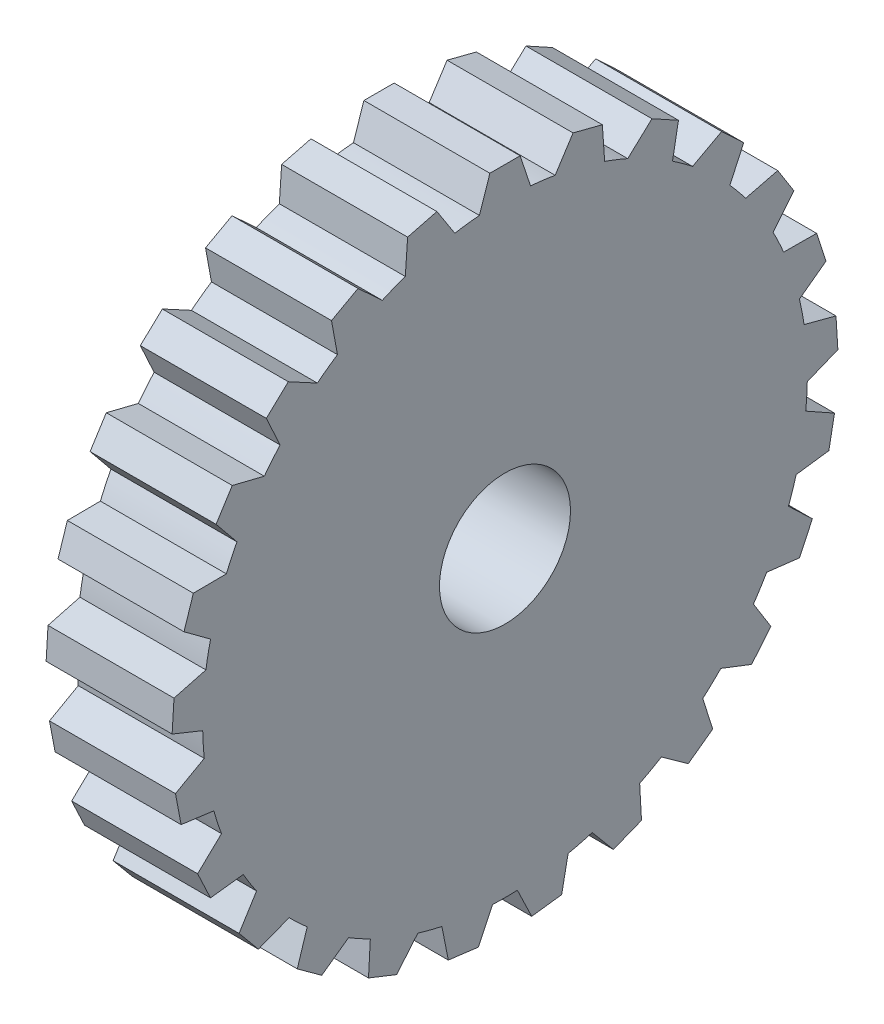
from build123d import *

# Parameters (mm, degrees)
SKETCH1_R           = 7.62
BOSS_EXTRUDE1_DEPTH = 3.175
BOSS_EXTRUDE2_DEPTH = 3.175
SKETCH3_R           = 1.651
CUT_EXTRUDE1_DEPTH  = 3.175


with BuildPart() as part:
    # Sketch1 → Boss-Extrude1 (new body)
    with BuildSketch(Plane(origin=(0, 0, 0), x_dir=(0, 0, -1), z_dir=(1, 0, 0))):
        Circle(SKETCH1_R)
    extrude(amount=BOSS_EXTRUDE1_DEPTH)

    # Sketch2 → Boss-Extrude2 (add)
    with BuildSketch(Plane(origin=(3.175, 0, 0), x_dir=(0, 0, -1), z_dir=(1, 0, 0))):
        Polygon((1.71548845, 8.213414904), (2.453548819, 8.02391321), (2.538326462, 6.822071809), (1.062205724, 7.201075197), align=None)
        Polygon((-0.381, 8.382), (0.381, 8.382), (0.762, 7.239), (-0.762, 7.239), align=None)
        Polygon((3.704186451, 7.528750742), (4.371932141, 7.161654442), (4.155160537, 5.976487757), (2.819669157, 6.710680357), align=None)
        Polygon((5.460136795, 6.371027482), (6.015610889, 5.849402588), (5.510910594, 4.755378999), (4.399962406, 5.798628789), align=None)
        Polygon((6.873006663, 4.812989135), (7.28130668, 4.169611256), (6.52038987, 3.23547229), (5.703789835, 4.522228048), align=None)
        Polygon((7.854020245, 2.95253298), (8.089491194, 2.227827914), (7.120169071, 1.512268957), (6.649227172, 2.961679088), align=None)
        Polygon((8.34153685, 0.906558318), (8.389383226, 0.146061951), (7.272561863, -0.305955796), (7.176869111, 1.215036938), align=None)
        Polygon((8.304924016, -1.196378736), (8.162139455, -1.944881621), (6.967992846, -2.104956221), (7.25356197, -0.607950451), align=None)
        Polygon((7.746482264, -3.224142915), (7.422038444, -3.913621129), (6.225599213, -3.771694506), (6.874486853, -2.392738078), align=None)
        Polygon((6.701300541, -5.049322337), (6.215583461, -5.636453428), (5.092028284, -5.201443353), (6.063462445, -4.027181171), align=None)
        Polygon((5.23505146, -6.557234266), (4.61858051, -7.005126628), (3.638506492, -6.304366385), (4.871448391, -5.40858166), align=None)
        Polygon((3.439864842, -7.65313105), (2.731375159, -7.933641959), (1.956363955, -7.01116289), (3.373343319, -6.450141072), align=None)
        Polygon((1.428538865, -8.268153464), (0.672547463, -8.363657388), (0.151295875, -7.277422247), (1.66327868, -7.086414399), align=None)
        Polygon((-0.672547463, -8.363657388), (-1.428538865, -8.268153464), (-1.66327868, -7.086414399), (-0.151295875, -7.277422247), align=None)
        Polygon((-2.731375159, -7.933641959), (-3.439864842, -7.65313105), (-3.373343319, -6.450141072), (-1.956363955, -7.01116289), align=None)
        Polygon((-4.61858051, -7.005126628), (-5.23505146, -6.557234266), (-4.871448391, -5.40858166), (-3.638506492, -6.304366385), align=None)
        Polygon((-6.215583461, -5.636453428), (-6.701300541, -5.049322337), (-6.063462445, -4.027181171), (-5.092028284, -5.201443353), align=None)
        Polygon((-7.422038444, -3.913621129), (-7.746482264, -3.224142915), (-6.874486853, -2.392738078), (-6.225599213, -3.771694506), align=None)
        Polygon((-8.162139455, -1.944881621), (-8.304924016, -1.196378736), (-7.25356197, -0.607950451), (-6.967992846, -2.104956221), align=None)
        Polygon((-8.389383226, 0.146061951), (-8.34153685, 0.906558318), (-7.176869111, 1.215036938), (-7.272561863, -0.305955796), align=None)
        Polygon((-8.089491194, 2.227827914), (-7.854020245, 2.95253298), (-6.649227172, 2.961679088), (-7.120169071, 1.512268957), align=None)
        Polygon((-7.28130668, 4.169611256), (-6.873006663, 4.812989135), (-5.703789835, 4.522228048), (-6.52038987, 3.23547229), align=None)
        Polygon((-6.015610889, 5.849402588), (-5.460136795, 6.371027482), (-4.399962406, 5.798628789), (-5.510910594, 4.755378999), align=None)
        Polygon((-4.371932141, 7.161654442), (-3.704186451, 7.528750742), (-2.819669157, 6.710680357), (-4.155160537, 5.976487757), align=None)
        Polygon((-2.453548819, 8.02391321), (-1.71548845, 8.213414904), (-1.062205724, 7.201075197), (-2.538326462, 6.822071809), align=None)
    extrude(amount=-BOSS_EXTRUDE2_DEPTH)

    # Sketch3 → Cut-Extrude1 (cut)
    with BuildSketch(Plane(origin=(3.175, 0, 0), x_dir=(0, 0, -1), z_dir=(1, 0, 0))):
        Circle(SKETCH3_R)
    extrude(amount=-CUT_EXTRUDE1_DEPTH, mode=Mode.SUBTRACT)


solid = part.part
